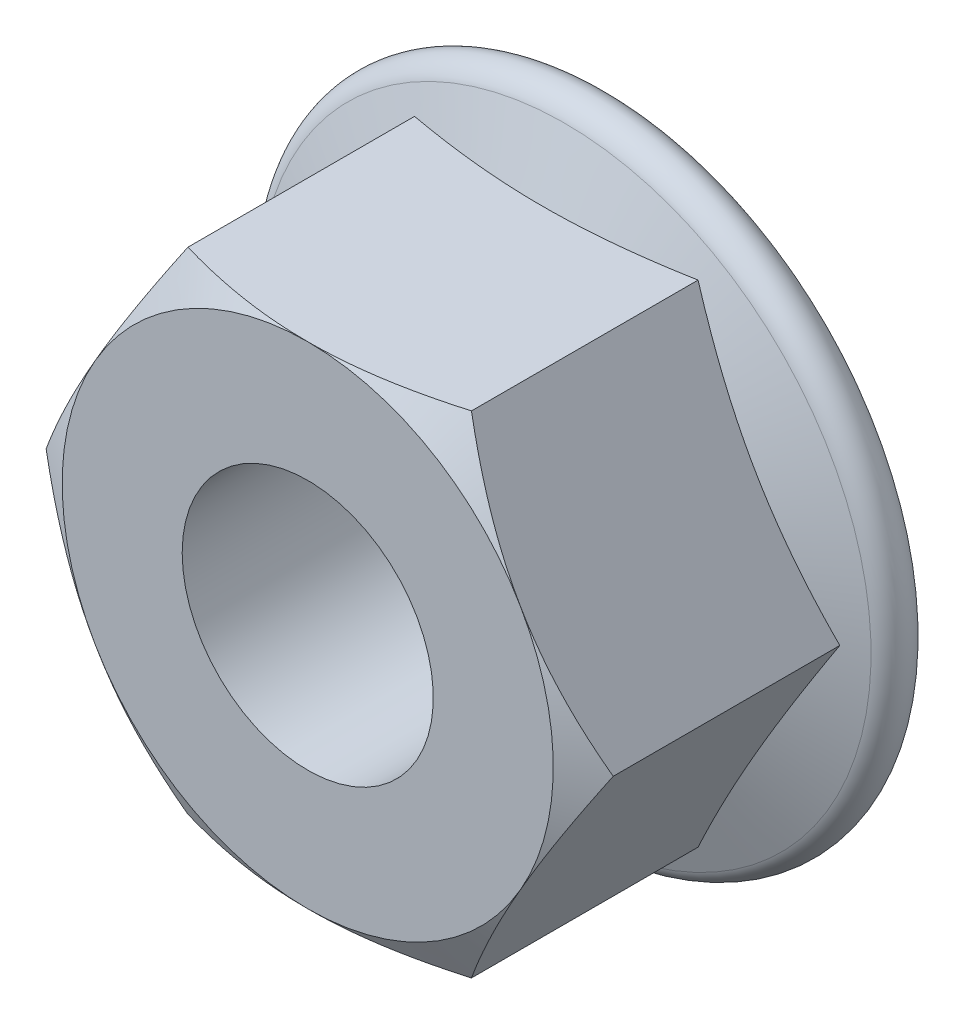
ISO-10303-21;
HEADER;
FILE_DESCRIPTION(('STEP AP214'),'2;1');
FILE_NAME('part.step','',(''),(''),'','','');
FILE_SCHEMA(('AUTOMOTIVE_DESIGN { 1 0 10303 214 1 1 1 1 }'));
ENDSEC;
DATA;
#1=APPLICATION_CONTEXT('core data for automotive mechanical design processes');
#2=APPLICATION_PROTOCOL_DEFINITION('international standard','automotive_design',2000,#1);
#3=PRODUCT_CONTEXT('',#1,'mechanical');
#4=PRODUCT('Part','Part','',(#3));
#5=PRODUCT_RELATED_PRODUCT_CATEGORY('part','',(#4));
#6=PRODUCT_DEFINITION_FORMATION('','',#4);
#7=PRODUCT_DEFINITION_CONTEXT('part definition',#1,'design');
#8=PRODUCT_DEFINITION('design','',#6,#7);
#9=PRODUCT_DEFINITION_SHAPE('','',#8);
#10=(LENGTH_UNIT() NAMED_UNIT(*) SI_UNIT(.MILLI.,.METRE.));
#11=(NAMED_UNIT(*) PLANE_ANGLE_UNIT() SI_UNIT($,.RADIAN.));
#12=(NAMED_UNIT(*) SI_UNIT($,.STERADIAN.) SOLID_ANGLE_UNIT());
#13=UNCERTAINTY_MEASURE_WITH_UNIT(LENGTH_MEASURE(1.E-05),#10,'distance_accuracy_value','');
#14=(GEOMETRIC_REPRESENTATION_CONTEXT(3) GLOBAL_UNCERTAINTY_ASSIGNED_CONTEXT((#13)) GLOBAL_UNIT_ASSIGNED_CONTEXT((#10,
#11,#12)) REPRESENTATION_CONTEXT('',''));
#15=CARTESIAN_POINT('',(0.,0.,0.));
#16=DIRECTION('',(0.,0.,1.));
#17=DIRECTION('',(1.,0.,0.));
#18=AXIS2_PLACEMENT_3D('',#15,#16,#17);
#19=CARTESIAN_POINT('',(-7.50555349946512,0.,8.));
#20=DIRECTION('',(0.86602540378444,-0.499999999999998,0.));
#21=DIRECTION('',(0.499999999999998,0.86602540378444,0.));
#22=AXIS2_PLACEMENT_3D('',#19,#20,#21);
#23=PLANE('',#22);
#24=CARTESIAN_POINT('',(-7.50566896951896,-0.000199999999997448,1.42053808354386));
#25=CARTESIAN_POINT('',(-7.35024872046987,0.268995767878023,1.47712763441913));
#26=CARTESIAN_POINT('',(-7.19431596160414,0.53907922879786,1.5286056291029));
#27=CARTESIAN_POINT('',(-6.88143655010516,1.08100226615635,1.61917320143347));
#28=CARTESIAN_POINT('',(-6.72448920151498,1.35284304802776,1.65825308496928));
#29=CARTESIAN_POINT('',(-6.41132237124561,1.89526390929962,1.7214636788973));
#30=CARTESIAN_POINT('',(-6.25511004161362,2.16583160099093,1.74573226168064));
#31=CARTESIAN_POINT('',(-5.94232007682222,2.70759971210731,1.77828325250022));
#32=CARTESIAN_POINT('',(-5.78574260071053,2.97879985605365,1.78657165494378));
#33=CARTESIAN_POINT('',(-5.47258764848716,3.52120014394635,1.78657165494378));
#34=CARTESIAN_POINT('',(-5.31601017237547,3.7924002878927,1.77828325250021));
#35=CARTESIAN_POINT('',(-5.00322020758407,4.33416839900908,1.74573226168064));
#36=CARTESIAN_POINT('',(-4.84700787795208,4.60473609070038,1.7214636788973));
#37=CARTESIAN_POINT('',(-4.53384104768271,5.14715695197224,1.65825308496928));
#38=CARTESIAN_POINT('',(-4.37689369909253,5.41899773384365,1.61917320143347));
#39=CARTESIAN_POINT('',(-4.06401428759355,5.96092077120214,1.52860562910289));
#40=CARTESIAN_POINT('',(-3.90808152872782,6.23100423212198,1.47712763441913));
#41=CARTESIAN_POINT('',(-3.75266127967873,6.5002,1.42053808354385));
#42=B_SPLINE_CURVE_WITH_KNOTS('',3,(#24,#25,#26,#27,#28,#29,#30,#31,#32,#33,#34,#35,#36,#37,#38,
#39,#40,#41),.UNSPECIFIED.,.F.,.F.,(4,2,2,2,2,2,2,2,4),(0.,0.947946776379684,1.89663293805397,
2.83634783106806,3.77571015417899,4.71507247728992,5.65478737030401,6.60347353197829,
7.55142030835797),.UNSPECIFIED.);
#43=CARTESIAN_POINT('',(-7.50555349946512,0.,1.42058011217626));
#44=VERTEX_POINT('',#43);
#45=CARTESIAN_POINT('',(-3.75277674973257,6.5,1.42058011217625));
#46=VERTEX_POINT('',#45);
#47=EDGE_CURVE('E122',#44,#46,#42,.T.);
#48=ORIENTED_EDGE('',*,*,#47,.F.);
#49=DIRECTION('',(0.,0.,-1.));
#50=VECTOR('',#49,1.);
#51=CARTESIAN_POINT('',(-7.50555349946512,0.,8.));
#52=LINE('',#51,#50);
#53=CARTESIAN_POINT('',(-7.50555349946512,0.,7.41944341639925));
#54=VERTEX_POINT('',#53);
#55=EDGE_CURVE('E252',#54,#44,#52,.T.);
#56=ORIENTED_EDGE('',*,*,#55,.F.);
#57=CARTESIAN_POINT('',(-7.50566896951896,-0.000199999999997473,7.41937674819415));
#58=CARTESIAN_POINT('',(-7.42317863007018,0.142677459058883,7.46699557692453));
#59=CARTESIAN_POINT('',(-7.34038072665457,0.286087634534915,7.51245329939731));
#60=CARTESIAN_POINT('',(-7.17411251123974,0.574072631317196,7.59845131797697));
#61=CARTESIAN_POINT('',(-7.09064192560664,0.718647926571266,7.63898949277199));
#62=CARTESIAN_POINT('',(-6.83889369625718,1.15468865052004,7.7524289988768));
#63=CARTESIAN_POINT('',(-6.6696223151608,1.44787528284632,7.81695219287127));
#64=CARTESIAN_POINT('',(-6.41631077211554,1.88662374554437,7.89261341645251));
#65=CARTESIAN_POINT('',(-6.33302748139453,2.03087463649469,7.91416714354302));
#66=CARTESIAN_POINT('',(-6.16608458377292,2.32002821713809,7.95030968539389));
#67=CARTESIAN_POINT('',(-6.08242501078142,2.46493084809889,7.96489911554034));
#68=CARTESIAN_POINT('',(-5.91496056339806,2.75498777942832,7.98674124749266));
#69=CARTESIAN_POINT('',(-5.8311559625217,2.90014160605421,7.9940022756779));
#70=CARTESIAN_POINT('',(-5.66347396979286,3.19057533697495,8.00103969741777));
#71=CARTESIAN_POINT('',(-5.5795965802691,3.33585523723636,8.0008163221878));
#72=CARTESIAN_POINT('',(-5.34979921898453,3.73387594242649,7.98991654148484));
#73=CARTESIAN_POINT('',(-5.20395446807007,3.98648646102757,7.97161818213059));
#74=CARTESIAN_POINT('',(-4.91323365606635,4.49002967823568,7.91359365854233));
#75=CARTESIAN_POINT('',(-4.76835861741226,4.74096060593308,7.87384766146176));
#76=CARTESIAN_POINT('',(-4.47705272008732,5.24551722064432,7.77449409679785));
#77=CARTESIAN_POINT('',(-4.33065861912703,5.49907924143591,7.71446557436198));
#78=CARTESIAN_POINT('',(-4.04005357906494,6.00242193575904,7.57822500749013));
#79=CARTESIAN_POINT('',(-3.89583891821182,6.25220905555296,7.50204496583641));
#80=CARTESIAN_POINT('',(-3.75266127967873,6.5002,7.41937674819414));
#81=B_SPLINE_CURVE_WITH_KNOTS('',3,(#57,#58,#59,#60,#61,#62,#63,#64,#65,#66,#67,#68,#69,#70,#71,
#72,#73,#74,#75,#76,#77,#78,#79,#80),.UNSPECIFIED.,.F.,.F.,(4,2,2,2,2,2,2,2,2,2,2,4),(0.,
0.515105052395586,1.03043143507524,2.06322554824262,2.56697389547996,3.07067772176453,
3.57380860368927,4.07692394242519,4.95279354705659,5.82947446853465,6.72559912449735,
7.61996451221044),.UNSPECIFIED.);
#82=CARTESIAN_POINT('',(-5.62916512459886,3.24999999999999,8.));
#83=VERTEX_POINT('',#82);
#84=EDGE_CURVE('E222',#54,#83,#81,.T.);
#85=ORIENTED_EDGE('',*,*,#84,.T.);
#86=CARTESIAN_POINT('',(-3.75277674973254,6.5,7.41944341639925));
#87=VERTEX_POINT('',#86);
#88=EDGE_CURVE('E217',#83,#87,#81,.T.);
#89=ORIENTED_EDGE('',*,*,#88,.T.);
#90=DIRECTION('',(0.,0.,-1.));
#91=VECTOR('',#90,1.);
#92=CARTESIAN_POINT('',(-3.75277674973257,6.5,8.));
#93=LINE('',#92,#91);
#94=EDGE_CURVE('E114',#87,#46,#93,.T.);
#95=ORIENTED_EDGE('',*,*,#94,.T.);
#96=EDGE_LOOP('',(#48,#56,#85,#89,#95));
#97=FACE_BOUND('',#96,.T.);
#98=ADVANCED_FACE('F29',(#97),#23,.F.);
#99=CARTESIAN_POINT('',(-3.75277674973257,-6.5,8.));
#100=DIRECTION('',(0.86602540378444,0.499999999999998,0.));
#101=DIRECTION('',(-0.499999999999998,0.86602540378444,0.));
#102=AXIS2_PLACEMENT_3D('',#99,#100,#101);
#103=PLANE('',#102);
#104=CARTESIAN_POINT('',(-3.75266127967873,-6.5002,1.42053808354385));
#105=CARTESIAN_POINT('',(-3.90808152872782,-6.23100423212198,1.47712763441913));
#106=CARTESIAN_POINT('',(-4.06401428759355,-5.96092077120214,1.52860562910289));
#107=CARTESIAN_POINT('',(-4.37689369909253,-5.41899773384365,1.61917320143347));
#108=CARTESIAN_POINT('',(-4.53384104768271,-5.14715695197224,1.65825308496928));
#109=CARTESIAN_POINT('',(-4.84700787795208,-4.60473609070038,1.7214636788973));
#110=CARTESIAN_POINT('',(-5.00322020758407,-4.33416839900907,1.74573226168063));
#111=CARTESIAN_POINT('',(-5.31601017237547,-3.79240028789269,1.77828325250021));
#112=CARTESIAN_POINT('',(-5.47258764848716,-3.52120014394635,1.78657165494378));
#113=CARTESIAN_POINT('',(-5.78574260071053,-2.97879985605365,1.78657165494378));
#114=CARTESIAN_POINT('',(-5.94232007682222,-2.7075997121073,1.77828325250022));
#115=CARTESIAN_POINT('',(-6.25511004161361,-2.16583160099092,1.74573226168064));
#116=CARTESIAN_POINT('',(-6.4113223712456,-1.89526390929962,1.7214636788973));
#117=CARTESIAN_POINT('',(-6.72448920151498,-1.35284304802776,1.65825308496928));
#118=CARTESIAN_POINT('',(-6.88143655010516,-1.08100226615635,1.61917320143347));
#119=CARTESIAN_POINT('',(-7.19431596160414,-0.539079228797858,1.5286056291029));
#120=CARTESIAN_POINT('',(-7.35024872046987,-0.26899576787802,1.47712763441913));
#121=CARTESIAN_POINT('',(-7.50566896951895,0.000200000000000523,1.42053808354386));
#122=B_SPLINE_CURVE_WITH_KNOTS('',3,(#104,#105,#106,#107,#108,#109,#110,#111,#112,#113,#114,
#115,#116,#117,#118,#119,#120,#121),.UNSPECIFIED.,.F.,.F.,(4,2,2,2,2,2,2,2,4),(0.,
0.947946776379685,1.89663293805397,2.83634783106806,3.77571015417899,4.71507247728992,
5.65478737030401,6.60347353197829,7.55142030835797),.UNSPECIFIED.);
#123=CARTESIAN_POINT('',(-3.75277674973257,-6.5,1.42058011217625));
#124=VERTEX_POINT('',#123);
#125=EDGE_CURVE('E49',#124,#44,#122,.T.);
#126=ORIENTED_EDGE('',*,*,#125,.F.);
#127=DIRECTION('',(0.,0.,-1.));
#128=VECTOR('',#127,1.);
#129=CARTESIAN_POINT('',(-3.75277674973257,-6.5,8.));
#130=LINE('',#129,#128);
#131=CARTESIAN_POINT('',(-3.75277674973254,-6.5,7.41944341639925));
#132=VERTEX_POINT('',#131);
#133=EDGE_CURVE('E238',#132,#124,#130,.T.);
#134=ORIENTED_EDGE('',*,*,#133,.F.);
#135=CARTESIAN_POINT('',(-3.75266127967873,-6.5002,7.41937674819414));
#136=CARTESIAN_POINT('',(-3.83515161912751,-6.35732254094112,7.46699557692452));
#137=CARTESIAN_POINT('',(-3.91794952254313,-6.21391236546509,7.5124532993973));
#138=CARTESIAN_POINT('',(-4.08421773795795,-5.9259273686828,7.59845131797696));
#139=CARTESIAN_POINT('',(-4.16768832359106,-5.78135207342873,7.63898949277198));
#140=CARTESIAN_POINT('',(-4.41943655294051,-5.34531134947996,7.75242899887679));
#141=CARTESIAN_POINT('',(-4.58870793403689,-5.05212471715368,7.81695219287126));
#142=CARTESIAN_POINT('',(-4.84201947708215,-4.61337625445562,7.89261341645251));
#143=CARTESIAN_POINT('',(-4.92530276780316,-4.46912536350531,7.91416714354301));
#144=CARTESIAN_POINT('',(-5.09224566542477,-4.17997178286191,7.95030968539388));
#145=CARTESIAN_POINT('',(-5.17590523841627,-4.03506915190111,7.96489911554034));
#146=CARTESIAN_POINT('',(-5.34336968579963,-3.74501222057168,7.98674124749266));
#147=CARTESIAN_POINT('',(-5.427174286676,-3.59985839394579,7.9940022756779));
#148=CARTESIAN_POINT('',(-5.59485627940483,-3.30942466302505,8.00103969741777));
#149=CARTESIAN_POINT('',(-5.6787336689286,-3.16414476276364,8.0008163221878));
#150=CARTESIAN_POINT('',(-5.90853103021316,-2.7661240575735,7.98991654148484));
#151=CARTESIAN_POINT('',(-6.05437578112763,-2.51351353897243,7.97161818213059));
#152=CARTESIAN_POINT('',(-6.34509659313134,-2.00997032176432,7.91359365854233));
#153=CARTESIAN_POINT('',(-6.48997163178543,-1.75903939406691,7.87384766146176));
#154=CARTESIAN_POINT('',(-6.78127752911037,-1.25448277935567,7.77449409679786));
#155=CARTESIAN_POINT('',(-6.92767163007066,-1.00092075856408,7.71446557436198));
#156=CARTESIAN_POINT('',(-7.21827667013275,-0.497578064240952,7.57822500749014));
#157=CARTESIAN_POINT('',(-7.36249133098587,-0.247790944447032,7.50204496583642));
#158=CARTESIAN_POINT('',(-7.50566896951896,0.000200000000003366,7.41937674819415));
#159=B_SPLINE_CURVE_WITH_KNOTS('',3,(#135,#136,#137,#138,#139,#140,#141,#142,#143,#144,#145,
#146,#147,#148,#149,#150,#151,#152,#153,#154,#155,#156,#157,#158),.UNSPECIFIED.,.F.,.F.,(4,2,2,
2,2,2,2,2,2,2,2,4),(0.,0.515105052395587,1.03043143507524,2.06322554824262,2.56697389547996,
3.07067772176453,3.57380860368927,4.0769239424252,4.9527935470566,5.82947446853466,
6.72559912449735,7.61996451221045),.UNSPECIFIED.);
#160=CARTESIAN_POINT('',(-5.62916512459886,-3.24999999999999,8.));
#161=VERTEX_POINT('',#160);
#162=EDGE_CURVE('E183',#132,#161,#159,.T.);
#163=ORIENTED_EDGE('',*,*,#162,.T.);
#164=EDGE_CURVE('E176',#161,#54,#159,.T.);
#165=ORIENTED_EDGE('',*,*,#164,.T.);
#166=ORIENTED_EDGE('',*,*,#55,.T.);
#167=EDGE_LOOP('',(#126,#134,#163,#165,#166));
#168=FACE_BOUND('',#167,.T.);
#169=ADVANCED_FACE('F168',(#168),#103,.F.);
#170=CARTESIAN_POINT('',(3.75277674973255,-6.5,8.));
#171=DIRECTION('',(0.,1.,0.));
#172=DIRECTION('',(-1.,0.,0.));
#173=AXIS2_PLACEMENT_3D('',#170,#171,#172);
#174=PLANE('',#173);
#175=CARTESIAN_POINT('',(-9.95705959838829,-6.5,-0.175548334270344));
#176=CARTESIAN_POINT('',(-9.66274604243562,-6.5,-0.0858731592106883));
#177=CARTESIAN_POINT('',(-9.36810918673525,-6.5,0.00276023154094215));
#178=CARTESIAN_POINT('',(-8.77802422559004,-6.5,0.177367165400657));
#179=CARTESIAN_POINT('',(-8.4825760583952,-6.5,0.263340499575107));
#180=CARTESIAN_POINT('',(-7.89020332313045,-6.5,0.432192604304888));
#181=CARTESIAN_POINT('',(-7.59327703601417,-6.5,0.515065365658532));
#182=CARTESIAN_POINT('',(-6.99832282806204,-6.5,0.67675165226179));
#183=CARTESIAN_POINT('',(-6.70029492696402,-6.5,0.755565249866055));
#184=CARTESIAN_POINT('',(-6.10661021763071,-6.5,0.907189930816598));
#185=CARTESIAN_POINT('',(-5.81096928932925,-6.5,0.980062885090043));
#186=CARTESIAN_POINT('',(-5.21821870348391,-6.5,1.11963621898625));
#187=CARTESIAN_POINT('',(-4.92110902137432,-6.5,1.18633649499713));
#188=CARTESIAN_POINT('',(-4.32535015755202,-6.5,1.31201642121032));
#189=CARTESIAN_POINT('',(-4.02670151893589,-6.5,1.37099862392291));
#190=CARTESIAN_POINT('',(-3.42766936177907,-6.5,1.47945221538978));
#191=CARTESIAN_POINT('',(-3.12728590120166,-6.5,1.52892392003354));
#192=CARTESIAN_POINT('',(-2.55856410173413,-6.5,1.61145620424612));
#193=CARTESIAN_POINT('',(-2.29040408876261,-6.5,1.64573416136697));
#194=CARTESIAN_POINT('',(-1.75294378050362,-6.5,1.70382895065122));
#195=CARTESIAN_POINT('',(-1.48364351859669,-6.5,1.72764608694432));
#196=CARTESIAN_POINT('',(-0.944449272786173,-6.5,1.76367259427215));
#197=CARTESIAN_POINT('',(-0.674555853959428,-6.5,1.77589028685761));
#198=CARTESIAN_POINT('',(-0.134489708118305,-6.5,1.78809886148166));
#199=CARTESIAN_POINT('',(0.135683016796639,-6.5,1.78808983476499));
#200=CARTESIAN_POINT('',(0.677117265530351,-6.5,1.7758142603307));
#201=CARTESIAN_POINT('',(0.948377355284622,-6.5,1.76348549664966));
#202=CARTESIAN_POINT('',(1.49010637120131,-6.5,1.72713736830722));
#203=CARTESIAN_POINT('',(1.76057527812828,-6.5,1.70311772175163));
#204=CARTESIAN_POINT('',(2.30058677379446,-6.5,1.64451587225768));
#205=CARTESIAN_POINT('',(2.57012835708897,-6.5,1.60992453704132));
#206=CARTESIAN_POINT('',(3.10786295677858,-6.5,1.53158869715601));
#207=CARTESIAN_POINT('',(3.37605596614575,-6.5,1.48784414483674));
#208=CARTESIAN_POINT('',(3.92636982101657,-6.5,1.38990681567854));
#209=CARTESIAN_POINT('',(4.20840900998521,-6.5,1.33525925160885));
#210=CARTESIAN_POINT('',(4.77103112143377,-6.5,1.21887860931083));
#211=CARTESIAN_POINT('',(5.05161393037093,-6.5,1.1571449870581));
#212=CARTESIAN_POINT('',(5.61152576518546,-6.5,1.02790295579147));
#213=CARTESIAN_POINT('',(5.89085439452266,-6.5,0.960392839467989));
#214=CARTESIAN_POINT('',(6.44832943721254,-6.5,0.820706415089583));
#215=CARTESIAN_POINT('',(6.72647587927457,-6.5,0.748530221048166));
#216=CARTESIAN_POINT('',(7.282115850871,-6.5,0.600292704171));
#217=CARTESIAN_POINT('',(7.55960805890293,-6.5,0.524226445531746));
#218=CARTESIAN_POINT('',(8.11372449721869,-6.5,0.368989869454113));
#219=CARTESIAN_POINT('',(8.39034871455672,-6.50000000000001,0.289819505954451));
#220=CARTESIAN_POINT('',(9.21901478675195,-6.50000000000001,0.0485467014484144));
#221=CARTESIAN_POINT('',(9.76995253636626,-6.50000000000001,-0.117345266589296));
#222=CARTESIAN_POINT('',(10.8636282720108,-6.50000000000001,-0.454181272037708));
#223=CARTESIAN_POINT('',(11.406389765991,-6.50000000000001,-0.625049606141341));
#224=CARTESIAN_POINT('',(12.4903900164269,-6.50000000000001,-0.971630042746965));
#225=CARTESIAN_POINT('',(13.0316286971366,-6.50000000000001,-1.14734238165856));
#226=CARTESIAN_POINT('',(14.1108650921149,-6.50000000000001,-1.50162139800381));
#227=CARTESIAN_POINT('',(14.6488672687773,-6.50000000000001,-1.68017451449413));
#228=CARTESIAN_POINT('',(15.4551843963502,-6.50000000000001,-1.94997777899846));
#229=CARTESIAN_POINT('',(15.7238314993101,-6.50000000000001,-2.04023741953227));
#230=CARTESIAN_POINT('',(16.2609289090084,-6.50000000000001,-2.22133828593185));
#231=CARTESIAN_POINT('',(16.5293792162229,-6.50000000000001,-2.31217951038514));
#232=CARTESIAN_POINT('',(16.7977440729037,-6.50000000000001,-2.40327244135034));
#233=B_SPLINE_CURVE_WITH_KNOTS('',3,(#175,#176,#177,#178,#179,#180,#181,#182,#183,#184,#185,
#186,#187,#188,#189,#190,#191,#192,#193,#194,#195,#196,#197,#198,#199,#200,#201,#202,#203,#204,
#205,#206,#207,#208,#209,#210,#211,#212,#213,#214,#215,#216,#217,#218,#219,#220,#221,#222,#223,
#224,#225,#226,#227,#228,#229,#230,#231,#232),.UNSPECIFIED.,.F.,.F.,(4,2,2,2,2,2,2,2,2,2,2,2,2,
2,2,2,2,2,2,2,2,2,2,2,2,2,2,2,4),(0.,0.923022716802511,1.84611774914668,2.77091780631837,
3.69570137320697,4.60911835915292,5.52255067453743,6.43568013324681,7.34877925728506,
8.15962762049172,8.97045240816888,9.78069506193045,10.5909316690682,11.4052808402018,
12.2196496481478,13.0347239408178,13.8498024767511,14.7115445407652,15.5733528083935,
16.4354166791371,17.2974594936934,18.1606246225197,19.0238025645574,20.7498399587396,
22.4568795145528,24.1640025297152,25.8645664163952,26.7147791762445,27.5649898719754),.UNSPECIFIED.);
#234=CARTESIAN_POINT('',(3.75277674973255,-6.5,1.42058011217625));
#235=VERTEX_POINT('',#234);
#236=EDGE_CURVE('E54',#235,#124,#233,.F.);
#237=ORIENTED_EDGE('',*,*,#236,.F.);
#238=DIRECTION('',(0.,0.,-1.));
#239=VECTOR('',#238,1.);
#240=CARTESIAN_POINT('',(3.75277674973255,-6.5,8.));
#241=LINE('',#240,#239);
#242=CARTESIAN_POINT('',(3.75277674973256,-6.49999999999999,7.41944341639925));
#243=VERTEX_POINT('',#242);
#244=EDGE_CURVE('E247',#243,#235,#241,.T.);
#245=ORIENTED_EDGE('',*,*,#244,.F.);
#246=CARTESIAN_POINT('',(-9.95291698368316,-6.5,4.88957641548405));
#247=CARTESIAN_POINT('',(-9.66753022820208,-6.5,5.02749106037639));
#248=CARTESIAN_POINT('',(-9.3814687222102,-6.5,5.16403471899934));
#249=CARTESIAN_POINT('',(-8.80763137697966,-6.5,5.43359663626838));
#250=CARTESIAN_POINT('',(-8.51985525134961,-6.5,5.56661428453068));
#251=CARTESIAN_POINT('',(-7.94066929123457,-6.5,5.82904149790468));
#252=CARTESIAN_POINT('',(-7.64924808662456,-6.5,5.95842605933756));
#253=CARTESIAN_POINT('',(-7.06401043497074,-6.5,6.21163779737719));
#254=CARTESIAN_POINT('',(-6.77019411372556,-6.5,6.33546526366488));
#255=CARTESIAN_POINT('',(-6.17605150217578,-6.5,6.5775551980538));
#256=CARTESIAN_POINT('',(-5.87568957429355,-6.5,6.69573068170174));
#257=CARTESIAN_POINT('',(-5.27142269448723,-6.5,6.92282610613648));
#258=CARTESIAN_POINT('',(-4.9675173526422,-6.5,7.03174501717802));
#259=CARTESIAN_POINT('',(-4.35630541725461,-6.5,7.23740097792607));
#260=CARTESIAN_POINT('',(-4.04900762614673,-6.5,7.33416392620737));
#261=CARTESIAN_POINT('',(-3.43004022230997,-6.5,7.51236428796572));
#262=CARTESIAN_POINT('',(-3.11837202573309,-6.5,7.59380654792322));
#263=CARTESIAN_POINT('',(-2.49046594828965,-6.5,7.73741591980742));
#264=CARTESIAN_POINT('',(-2.17422687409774,-6.5,7.79957789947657));
#265=CARTESIAN_POINT('',(-1.5378916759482,-6.5,7.90042577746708));
#266=CARTESIAN_POINT('',(-1.21779554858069,-6.5,7.93911165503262));
#267=CARTESIAN_POINT('',(-0.73714196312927,-6.5,7.977053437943));
#268=CARTESIAN_POINT('',(-0.577336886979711,-6.5,7.98635478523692));
#269=CARTESIAN_POINT('',(-0.257468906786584,-6.5,7.99818591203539));
#270=CARTESIAN_POINT('',(-0.0974060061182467,-6.5,8.00071577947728));
#271=CARTESIAN_POINT('',(0.222635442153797,-6.5,7.99893598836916));
#272=CARTESIAN_POINT('',(0.382614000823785,-6.5,7.99462824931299));
#273=CARTESIAN_POINT('',(0.702250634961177,-6.5,7.97928241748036));
#274=CARTESIAN_POINT('',(0.86190869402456,-6.5,7.96824398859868));
#275=CARTESIAN_POINT('',(1.24887053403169,-6.5,7.93356313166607));
#276=CARTESIAN_POINT('',(1.47587694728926,-6.5,7.90654812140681));
#277=CARTESIAN_POINT('',(1.92815030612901,-6.5,7.84041011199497));
#278=CARTESIAN_POINT('',(2.15341675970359,-6.5,7.80128380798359));
#279=CARTESIAN_POINT('',(2.60202427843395,-6.5,7.71231082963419));
#280=CARTESIAN_POINT('',(2.82536331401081,-6.5,7.6624540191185));
#281=CARTESIAN_POINT('',(3.26974354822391,-6.5,7.55354123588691));
#282=CARTESIAN_POINT('',(3.49078496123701,-6.5,7.4944861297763));
#283=CARTESIAN_POINT('',(3.93601414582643,-6.5,7.3670458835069));
#284=CARTESIAN_POINT('',(4.16014622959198,-6.5,7.29846752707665));
#285=CARTESIAN_POINT('',(4.60604131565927,-6.5,7.15453487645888));
#286=CARTESIAN_POINT('',(4.82780583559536,-6.5,7.07918525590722));
#287=CARTESIAN_POINT('',(5.26807593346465,-6.5,6.92326649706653));
#288=CARTESIAN_POINT('',(5.48659282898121,-6.5,6.84272912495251));
#289=CARTESIAN_POINT('',(5.92193123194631,-6.5,6.6769272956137));
#290=CARTESIAN_POINT('',(6.13875201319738,-6.5,6.59166092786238));
#291=CARTESIAN_POINT('',(6.35478510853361,-6.5,6.50449786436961));
#292=B_SPLINE_CURVE_WITH_KNOTS('',3,(#246,#247,#248,#249,#250,#251,#252,#253,#254,#255,#256,
#257,#258,#259,#260,#261,#262,#263,#264,#265,#266,#267,#268,#269,#270,#271,#272,#273,#274,#275,
#276,#277,#278,#279,#280,#281,#282,#283,#284,#285,#286,#287,#288,#289,#290,#291),.UNSPECIFIED.,
.F.,.F.,(4,2,2,2,2,2,2,2,2,2,2,2,2,2,2,2,2,2,2,2,2,2,4),(0.,0.950904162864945,1.90197187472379,
2.85848216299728,3.81494253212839,4.78314526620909,5.75145556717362,6.71766655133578,
7.6835713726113,8.64973308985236,9.61589566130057,10.0960003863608,10.5760988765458,
11.0560626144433,11.5360503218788,12.2214931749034,12.9071232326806,13.5934038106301,
14.2796197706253,14.9826563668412,15.685211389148,16.3838119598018,17.0826968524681),.UNSPECIFIED.);
#293=CARTESIAN_POINT('',(0.,-6.5,8.));
#294=VERTEX_POINT('',#293);
#295=EDGE_CURVE('E234',#243,#294,#292,.F.);
#296=ORIENTED_EDGE('',*,*,#295,.T.);
#297=EDGE_CURVE('E189',#294,#132,#292,.F.);
#298=ORIENTED_EDGE('',*,*,#297,.T.);
#299=ORIENTED_EDGE('',*,*,#133,.T.);
#300=EDGE_LOOP('',(#237,#245,#296,#298,#299));
#301=FACE_BOUND('',#300,.T.);
#302=ADVANCED_FACE('F171',(#301),#174,.F.);
#303=CARTESIAN_POINT('',(7.50555349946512,0.,8.));
#304=DIRECTION('',(-0.866025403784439,0.5,0.));
#305=DIRECTION('',(-0.5,-0.866025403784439,0.));
#306=AXIS2_PLACEMENT_3D('',#303,#304,#305);
#307=PLANE('',#306);
#308=CARTESIAN_POINT('',(7.50566896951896,0.000200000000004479,1.42053808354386));
#309=CARTESIAN_POINT('',(7.35024872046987,-0.268995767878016,1.47712763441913));
#310=CARTESIAN_POINT('',(7.19431596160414,-0.539079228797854,1.5286056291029));
#311=CARTESIAN_POINT('',(6.88143655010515,-1.08100226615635,1.61917320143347));
#312=CARTESIAN_POINT('',(6.72448920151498,-1.35284304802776,1.65825308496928));
#313=CARTESIAN_POINT('',(6.4113223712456,-1.89526390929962,1.72146367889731));
#314=CARTESIAN_POINT('',(6.25511004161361,-2.16583160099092,1.74573226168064));
#315=CARTESIAN_POINT('',(5.94232007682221,-2.7075997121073,1.77828325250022));
#316=CARTESIAN_POINT('',(5.78574260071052,-2.97879985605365,1.78657165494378));
#317=CARTESIAN_POINT('',(5.47258764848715,-3.52120014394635,1.78657165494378));
#318=CARTESIAN_POINT('',(5.31601017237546,-3.79240028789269,1.77828325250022));
#319=CARTESIAN_POINT('',(5.00322020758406,-4.33416839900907,1.74573226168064));
#320=CARTESIAN_POINT('',(4.84700787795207,-4.60473609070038,1.72146367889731));
#321=CARTESIAN_POINT('',(4.53384104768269,-5.14715695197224,1.65825308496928));
#322=CARTESIAN_POINT('',(4.37689369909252,-5.41899773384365,1.61917320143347));
#323=CARTESIAN_POINT('',(4.06401428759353,-5.96092077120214,1.5286056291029));
#324=CARTESIAN_POINT('',(3.9080815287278,-6.23100423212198,1.47712763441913));
#325=CARTESIAN_POINT('',(3.75266127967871,-6.5002,1.42053808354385));
#326=B_SPLINE_CURVE_WITH_KNOTS('',3,(#308,#309,#310,#311,#312,#313,#314,#315,#316,#317,#318,
#319,#320,#321,#322,#323,#324,#325),.UNSPECIFIED.,.F.,.F.,(4,2,2,2,2,2,2,2,4),(0.,
0.947946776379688,1.89663293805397,2.83634783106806,3.775710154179,4.71507247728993,
5.65478737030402,6.6034735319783,7.55142030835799),.UNSPECIFIED.);
#327=CARTESIAN_POINT('',(7.50555349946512,0.,1.42058011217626));
#328=VERTEX_POINT('',#327);
#329=EDGE_CURVE('E130',#328,#235,#326,.T.);
#330=ORIENTED_EDGE('',*,*,#329,.F.);
#331=DIRECTION('',(0.,0.,-1.));
#332=VECTOR('',#331,1.);
#333=CARTESIAN_POINT('',(7.50555349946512,0.,8.));
#334=LINE('',#333,#332);
#335=CARTESIAN_POINT('',(7.50555349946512,0.,7.41944341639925));
#336=VERTEX_POINT('',#335);
#337=EDGE_CURVE('E113',#336,#328,#334,.T.);
#338=ORIENTED_EDGE('',*,*,#337,.F.);
#339=CARTESIAN_POINT('',(7.50566896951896,0.0002000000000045,7.41937674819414));
#340=CARTESIAN_POINT('',(7.42317863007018,-0.142677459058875,7.46699557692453));
#341=CARTESIAN_POINT('',(7.34038072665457,-0.286087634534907,7.5124532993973));
#342=CARTESIAN_POINT('',(7.17411251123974,-0.574072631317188,7.59845131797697));
#343=CARTESIAN_POINT('',(7.09064192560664,-0.718647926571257,7.63898949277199));
#344=CARTESIAN_POINT('',(6.83889369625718,-1.15468865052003,7.7524289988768));
#345=CARTESIAN_POINT('',(6.66962231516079,-1.44787528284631,7.81695219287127));
#346=CARTESIAN_POINT('',(6.41631077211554,-1.88662374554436,7.89261341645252));
#347=CARTESIAN_POINT('',(6.33302748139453,-2.03087463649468,7.91416714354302));
#348=CARTESIAN_POINT('',(6.16608458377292,-2.32002821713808,7.95030968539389));
#349=CARTESIAN_POINT('',(6.08242501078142,-2.46493084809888,7.96489911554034));
#350=CARTESIAN_POINT('',(5.91496056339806,-2.75498777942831,7.98674124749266));
#351=CARTESIAN_POINT('',(5.83115596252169,-2.9001416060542,7.9940022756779));
#352=CARTESIAN_POINT('',(5.66347396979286,-3.19057533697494,8.00103969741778));
#353=CARTESIAN_POINT('',(5.57959658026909,-3.33585523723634,8.0008163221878));
#354=CARTESIAN_POINT('',(5.34979921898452,-3.73387594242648,7.98991654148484));
#355=CARTESIAN_POINT('',(5.20395446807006,-3.98648646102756,7.9716181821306));
#356=CARTESIAN_POINT('',(4.91323365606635,-4.49002967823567,7.91359365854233));
#357=CARTESIAN_POINT('',(4.76835861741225,-4.74096060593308,7.87384766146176));
#358=CARTESIAN_POINT('',(4.4770527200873,-5.24551722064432,7.77449409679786));
#359=CARTESIAN_POINT('',(4.33065861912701,-5.49907924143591,7.71446557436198));
#360=CARTESIAN_POINT('',(4.04005357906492,-6.00242193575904,7.57822500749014));
#361=CARTESIAN_POINT('',(3.8958389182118,-6.25220905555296,7.50204496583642));
#362=CARTESIAN_POINT('',(3.75266127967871,-6.5002,7.41937674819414));
#363=B_SPLINE_CURVE_WITH_KNOTS('',3,(#339,#340,#341,#342,#343,#344,#345,#346,#347,#348,#349,
#350,#351,#352,#353,#354,#355,#356,#357,#358,#359,#360,#361,#362),.UNSPECIFIED.,.F.,.F.,(4,2,2,
2,2,2,2,2,2,2,2,4),(0.,0.515105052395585,1.03043143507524,2.06322554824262,2.56697389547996,
3.07067772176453,3.57380860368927,4.07692394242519,4.95279354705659,5.82947446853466,
6.72559912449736,7.61996451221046),.UNSPECIFIED.);
#364=CARTESIAN_POINT('',(5.62916512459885,-3.25,8.));
#365=VERTEX_POINT('',#364);
#366=EDGE_CURVE('E184',#336,#365,#363,.T.);
#367=ORIENTED_EDGE('',*,*,#366,.T.);
#368=EDGE_CURVE('E228',#365,#243,#363,.T.);
#369=ORIENTED_EDGE('',*,*,#368,.T.);
#370=ORIENTED_EDGE('',*,*,#244,.T.);
#371=EDGE_LOOP('',(#330,#338,#367,#369,#370));
#372=FACE_BOUND('',#371,.T.);
#373=ADVANCED_FACE('F282',(#372),#307,.F.);
#374=CARTESIAN_POINT('',(3.75277674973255,6.5,8.));
#375=DIRECTION('',(-0.866025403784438,-0.500000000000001,0.));
#376=DIRECTION('',(0.500000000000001,-0.866025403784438,0.));
#377=AXIS2_PLACEMENT_3D('',#374,#375,#376);
#378=PLANE('',#377);
#379=CARTESIAN_POINT('',(3.75266127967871,6.5002,1.42053808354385));
#380=CARTESIAN_POINT('',(3.90808152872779,6.23100423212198,1.47712763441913));
#381=CARTESIAN_POINT('',(4.06401428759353,5.96092077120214,1.5286056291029));
#382=CARTESIAN_POINT('',(4.37689369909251,5.41899773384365,1.61917320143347));
#383=CARTESIAN_POINT('',(4.53384104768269,5.14715695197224,1.65825308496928));
#384=CARTESIAN_POINT('',(4.84700787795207,4.60473609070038,1.7214636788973));
#385=CARTESIAN_POINT('',(5.00322020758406,4.33416839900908,1.74573226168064));
#386=CARTESIAN_POINT('',(5.31601017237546,3.7924002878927,1.77828325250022));
#387=CARTESIAN_POINT('',(5.47258764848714,3.52120014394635,1.78657165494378));
#388=CARTESIAN_POINT('',(5.78574260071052,2.97879985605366,1.78657165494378));
#389=CARTESIAN_POINT('',(5.94232007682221,2.70759971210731,1.77828325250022));
#390=CARTESIAN_POINT('',(6.25511004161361,2.16583160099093,1.74573226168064));
#391=CARTESIAN_POINT('',(6.4113223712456,1.89526390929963,1.72146367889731));
#392=CARTESIAN_POINT('',(6.72448920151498,1.35284304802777,1.65825308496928));
#393=CARTESIAN_POINT('',(6.88143655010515,1.08100226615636,1.61917320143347));
#394=CARTESIAN_POINT('',(7.19431596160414,0.539079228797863,1.5286056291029));
#395=CARTESIAN_POINT('',(7.35024872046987,0.268995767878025,1.47712763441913));
#396=CARTESIAN_POINT('',(7.50566896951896,-0.000199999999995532,1.42053808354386));
#397=B_SPLINE_CURVE_WITH_KNOTS('',3,(#379,#380,#381,#382,#383,#384,#385,#386,#387,#388,#389,
#390,#391,#392,#393,#394,#395,#396),.UNSPECIFIED.,.F.,.F.,(4,2,2,2,2,2,2,2,4),(0.,
0.947946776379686,1.89663293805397,2.83634783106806,3.77571015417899,4.71507247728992,
5.65478737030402,6.6034735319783,7.55142030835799),.UNSPECIFIED.);
#398=CARTESIAN_POINT('',(3.75277674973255,6.5,1.42058011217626));
#399=VERTEX_POINT('',#398);
#400=EDGE_CURVE('E118',#399,#328,#397,.T.);
#401=ORIENTED_EDGE('',*,*,#400,.F.);
#402=DIRECTION('',(0.,0.,-1.));
#403=VECTOR('',#402,1.);
#404=CARTESIAN_POINT('',(3.75277674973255,6.5,8.));
#405=LINE('',#404,#403);
#406=CARTESIAN_POINT('',(3.75277674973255,6.5,7.41944341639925));
#407=VERTEX_POINT('',#406);
#408=EDGE_CURVE('E104',#407,#399,#405,.T.);
#409=ORIENTED_EDGE('',*,*,#408,.F.);
#410=CARTESIAN_POINT('',(3.75266127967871,6.5002,7.41937674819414));
#411=CARTESIAN_POINT('',(3.83515161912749,6.35732254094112,7.46699557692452));
#412=CARTESIAN_POINT('',(3.9179495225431,6.21391236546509,7.5124532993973));
#413=CARTESIAN_POINT('',(4.08421773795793,5.92592736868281,7.59845131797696));
#414=CARTESIAN_POINT('',(4.16768832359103,5.78135207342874,7.63898949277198));
#415=CARTESIAN_POINT('',(4.4194365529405,5.34531134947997,7.7524289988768));
#416=CARTESIAN_POINT('',(4.58870793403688,5.05212471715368,7.81695219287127));
#417=CARTESIAN_POINT('',(4.84201947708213,4.61337625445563,7.89261341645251));
#418=CARTESIAN_POINT('',(4.92530276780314,4.46912536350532,7.91416714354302));
#419=CARTESIAN_POINT('',(5.09224566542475,4.17997178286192,7.95030968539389));
#420=CARTESIAN_POINT('',(5.17590523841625,4.03506915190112,7.96489911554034));
#421=CARTESIAN_POINT('',(5.34336968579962,3.74501222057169,7.98674124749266));
#422=CARTESIAN_POINT('',(5.42717428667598,3.5998583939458,7.9940022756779));
#423=CARTESIAN_POINT('',(5.59485627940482,3.30942466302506,8.00103969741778));
#424=CARTESIAN_POINT('',(5.67873366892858,3.16414476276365,8.0008163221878));
#425=CARTESIAN_POINT('',(5.90853103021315,2.76612405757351,7.98991654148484));
#426=CARTESIAN_POINT('',(6.05437578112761,2.51351353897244,7.9716181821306));
#427=CARTESIAN_POINT('',(6.34509659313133,2.00997032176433,7.91359365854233));
#428=CARTESIAN_POINT('',(6.48997163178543,1.75903939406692,7.87384766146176));
#429=CARTESIAN_POINT('',(6.78127752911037,1.25448277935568,7.77449409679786));
#430=CARTESIAN_POINT('',(6.92767163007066,1.00092075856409,7.71446557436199));
#431=CARTESIAN_POINT('',(7.21827667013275,0.497578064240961,7.57822500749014));
#432=CARTESIAN_POINT('',(7.36249133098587,0.247790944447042,7.50204496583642));
#433=CARTESIAN_POINT('',(7.50566896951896,-0.000199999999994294,7.41937674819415));
#434=B_SPLINE_CURVE_WITH_KNOTS('',3,(#410,#411,#412,#413,#414,#415,#416,#417,#418,#419,#420,
#421,#422,#423,#424,#425,#426,#427,#428,#429,#430,#431,#432,#433),.UNSPECIFIED.,.F.,.F.,(4,2,2,
2,2,2,2,2,2,2,2,4),(0.,0.515105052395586,1.03043143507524,2.06322554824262,2.56697389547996,
3.07067772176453,3.57380860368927,4.07692394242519,4.9527935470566,5.82947446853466,
6.72559912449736,7.61996451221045),.UNSPECIFIED.);
#435=CARTESIAN_POINT('',(5.62916512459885,3.25,8.));
#436=VERTEX_POINT('',#435);
#437=EDGE_CURVE('E212',#407,#436,#434,.T.);
#438=ORIENTED_EDGE('',*,*,#437,.T.);
#439=EDGE_CURVE('E224',#436,#336,#434,.T.);
#440=ORIENTED_EDGE('',*,*,#439,.T.);
#441=ORIENTED_EDGE('',*,*,#337,.T.);
#442=EDGE_LOOP('',(#401,#409,#438,#440,#441));
#443=FACE_BOUND('',#442,.T.);
#444=ADVANCED_FACE('F119',(#443),#378,.F.);
#445=CARTESIAN_POINT('',(-3.75277674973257,6.5,8.));
#446=DIRECTION('',(0.,-1.,0.));
#447=DIRECTION('',(1.,0.,0.));
#448=AXIS2_PLACEMENT_3D('',#445,#446,#447);
#449=PLANE('',#448);
#450=CARTESIAN_POINT('',(-9.95705959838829,6.5,-0.175548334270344));
#451=CARTESIAN_POINT('',(-9.66274604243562,6.5,-0.0858731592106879));
#452=CARTESIAN_POINT('',(-9.36810918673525,6.5,0.00276023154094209));
#453=CARTESIAN_POINT('',(-8.77802422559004,6.5,0.177367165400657));
#454=CARTESIAN_POINT('',(-8.4825760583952,6.5,0.263340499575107));
#455=CARTESIAN_POINT('',(-7.89020332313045,6.5,0.432192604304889));
#456=CARTESIAN_POINT('',(-7.59327703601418,6.5,0.515065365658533));
#457=CARTESIAN_POINT('',(-6.99832282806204,6.5,0.676751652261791));
#458=CARTESIAN_POINT('',(-6.70029492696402,6.5,0.755565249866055));
#459=CARTESIAN_POINT('',(-6.10661021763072,6.5,0.907189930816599));
#460=CARTESIAN_POINT('',(-5.81096928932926,6.5,0.980062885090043));
#461=CARTESIAN_POINT('',(-5.21821870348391,6.5,1.11963621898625));
#462=CARTESIAN_POINT('',(-4.92110902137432,6.5,1.18633649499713));
#463=CARTESIAN_POINT('',(-4.32535015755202,6.5,1.31201642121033));
#464=CARTESIAN_POINT('',(-4.02670151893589,6.5,1.37099862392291));
#465=CARTESIAN_POINT('',(-3.42766936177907,6.5,1.47945221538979));
#466=CARTESIAN_POINT('',(-3.12728590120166,6.5,1.52892392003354));
#467=CARTESIAN_POINT('',(-2.55856410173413,6.5,1.61145620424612));
#468=CARTESIAN_POINT('',(-2.29040408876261,6.5,1.64573416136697));
#469=CARTESIAN_POINT('',(-1.75294378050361,6.5,1.70382895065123));
#470=CARTESIAN_POINT('',(-1.48364351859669,6.5,1.72764608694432));
#471=CARTESIAN_POINT('',(-0.944449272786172,6.5,1.76367259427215));
#472=CARTESIAN_POINT('',(-0.674555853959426,6.5,1.77589028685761));
#473=CARTESIAN_POINT('',(-0.134489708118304,6.5,1.78809886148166));
#474=CARTESIAN_POINT('',(0.13568301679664,6.5,1.78808983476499));
#475=CARTESIAN_POINT('',(0.677117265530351,6.5,1.7758142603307));
#476=CARTESIAN_POINT('',(0.948377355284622,6.5,1.76348549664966));
#477=CARTESIAN_POINT('',(1.49010637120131,6.5,1.72713736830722));
#478=CARTESIAN_POINT('',(1.76057527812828,6.5,1.70311772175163));
#479=CARTESIAN_POINT('',(2.30058677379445,6.5,1.64451587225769));
#480=CARTESIAN_POINT('',(2.57012835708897,6.5,1.60992453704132));
#481=CARTESIAN_POINT('',(3.10786295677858,6.5,1.53158869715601));
#482=CARTESIAN_POINT('',(3.37605596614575,6.5,1.48784414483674));
#483=CARTESIAN_POINT('',(3.92636982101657,6.5,1.38990681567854));
#484=CARTESIAN_POINT('',(4.2084090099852,6.5,1.33525925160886));
#485=CARTESIAN_POINT('',(4.77103112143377,6.5,1.21887860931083));
#486=CARTESIAN_POINT('',(5.05161393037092,6.5,1.1571449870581));
#487=CARTESIAN_POINT('',(5.61152576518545,6.5,1.02790295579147));
#488=CARTESIAN_POINT('',(5.89085439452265,6.5,0.960392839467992));
#489=CARTESIAN_POINT('',(6.44832943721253,6.5,0.820706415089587));
#490=CARTESIAN_POINT('',(6.72647587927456,6.5,0.74853022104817));
#491=CARTESIAN_POINT('',(7.28211585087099,6.5,0.600292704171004));
#492=CARTESIAN_POINT('',(7.55960805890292,6.5,0.52422644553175));
#493=CARTESIAN_POINT('',(8.11372449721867,6.5,0.368989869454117));
#494=CARTESIAN_POINT('',(8.3903487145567,6.50000000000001,0.289819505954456));
#495=CARTESIAN_POINT('',(9.21901478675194,6.50000000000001,0.0485467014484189));
#496=CARTESIAN_POINT('',(9.76995253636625,6.50000000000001,-0.117345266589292));
#497=CARTESIAN_POINT('',(10.8636282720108,6.50000000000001,-0.454181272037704));
#498=CARTESIAN_POINT('',(11.406389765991,6.50000000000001,-0.625049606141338));
#499=CARTESIAN_POINT('',(12.4903900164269,6.50000000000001,-0.971630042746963));
#500=CARTESIAN_POINT('',(13.0316286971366,6.50000000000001,-1.14734238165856));
#501=CARTESIAN_POINT('',(14.1108650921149,6.50000000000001,-1.50162139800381));
#502=CARTESIAN_POINT('',(14.6488672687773,6.50000000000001,-1.68017451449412));
#503=CARTESIAN_POINT('',(15.4551843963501,6.50000000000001,-1.94997777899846));
#504=CARTESIAN_POINT('',(15.7238314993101,6.50000000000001,-2.04023741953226));
#505=CARTESIAN_POINT('',(16.2609289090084,6.50000000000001,-2.22133828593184));
#506=CARTESIAN_POINT('',(16.5293792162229,6.50000000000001,-2.31217951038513));
#507=CARTESIAN_POINT('',(16.7977440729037,6.50000000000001,-2.40327244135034));
#508=B_SPLINE_CURVE_WITH_KNOTS('',3,(#450,#451,#452,#453,#454,#455,#456,#457,#458,#459,#460,
#461,#462,#463,#464,#465,#466,#467,#468,#469,#470,#471,#472,#473,#474,#475,#476,#477,#478,#479,
#480,#481,#482,#483,#484,#485,#486,#487,#488,#489,#490,#491,#492,#493,#494,#495,#496,#497,#498,
#499,#500,#501,#502,#503,#504,#505,#506,#507),.UNSPECIFIED.,.F.,.F.,(4,2,2,2,2,2,2,2,2,2,2,2,2,
2,2,2,2,2,2,2,2,2,2,2,2,2,2,2,4),(0.,0.923022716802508,1.84611774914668,2.77091780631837,
3.69570137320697,4.60911835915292,5.52255067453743,6.43568013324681,7.34877925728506,
8.15962762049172,8.97045240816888,9.78069506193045,10.5909316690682,11.4052808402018,
12.2196496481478,13.0347239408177,13.8498024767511,14.7115445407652,15.5733528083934,
16.4354166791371,17.2974594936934,18.1606246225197,19.0238025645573,20.7498399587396,
22.4568795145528,24.1640025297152,25.8645664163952,26.7147791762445,27.5649898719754),.UNSPECIFIED.);
#509=EDGE_CURVE('E11',#46,#399,#508,.T.);
#510=ORIENTED_EDGE('',*,*,#509,.F.);
#511=ORIENTED_EDGE('',*,*,#94,.F.);
#512=CARTESIAN_POINT('',(-9.95291698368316,6.5,4.88957641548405));
#513=CARTESIAN_POINT('',(-9.66753022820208,6.5,5.02749106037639));
#514=CARTESIAN_POINT('',(-9.3814687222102,6.5,5.16403471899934));
#515=CARTESIAN_POINT('',(-8.80763137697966,6.5,5.43359663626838));
#516=CARTESIAN_POINT('',(-8.51985525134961,6.5,5.56661428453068));
#517=CARTESIAN_POINT('',(-7.94066929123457,6.5,5.82904149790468));
#518=CARTESIAN_POINT('',(-7.64924808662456,6.5,5.95842605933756));
#519=CARTESIAN_POINT('',(-7.06401043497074,6.5,6.21163779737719));
#520=CARTESIAN_POINT('',(-6.77019411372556,6.5,6.33546526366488));
#521=CARTESIAN_POINT('',(-6.17605150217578,6.5,6.5775551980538));
#522=CARTESIAN_POINT('',(-5.87568957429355,6.5,6.69573068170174));
#523=CARTESIAN_POINT('',(-5.27142269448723,6.5,6.92282610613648));
#524=CARTESIAN_POINT('',(-4.9675173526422,6.5,7.03174501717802));
#525=CARTESIAN_POINT('',(-4.35630541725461,6.5,7.23740097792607));
#526=CARTESIAN_POINT('',(-4.04900762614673,6.5,7.33416392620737));
#527=CARTESIAN_POINT('',(-3.43004022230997,6.5,7.51236428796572));
#528=CARTESIAN_POINT('',(-3.11837202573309,6.5,7.59380654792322));
#529=CARTESIAN_POINT('',(-2.49046594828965,6.5,7.73741591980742));
#530=CARTESIAN_POINT('',(-2.17422687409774,6.5,7.79957789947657));
#531=CARTESIAN_POINT('',(-1.5378916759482,6.5,7.90042577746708));
#532=CARTESIAN_POINT('',(-1.21779554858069,6.5,7.93911165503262));
#533=CARTESIAN_POINT('',(-0.73714196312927,6.5,7.977053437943));
#534=CARTESIAN_POINT('',(-0.577336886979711,6.5,7.98635478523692));
#535=CARTESIAN_POINT('',(-0.257468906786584,6.5,7.99818591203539));
#536=CARTESIAN_POINT('',(-0.0974060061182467,6.5,8.00071577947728));
#537=CARTESIAN_POINT('',(0.222635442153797,6.5,7.99893598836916));
#538=CARTESIAN_POINT('',(0.382614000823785,6.5,7.99462824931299));
#539=CARTESIAN_POINT('',(0.702250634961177,6.5,7.97928241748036));
#540=CARTESIAN_POINT('',(0.86190869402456,6.5,7.96824398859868));
#541=CARTESIAN_POINT('',(1.24887053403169,6.5,7.93356313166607));
#542=CARTESIAN_POINT('',(1.47587694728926,6.5,7.90654812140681));
#543=CARTESIAN_POINT('',(1.92815030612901,6.5,7.84041011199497));
#544=CARTESIAN_POINT('',(2.15341675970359,6.5,7.80128380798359));
#545=CARTESIAN_POINT('',(2.60202427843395,6.5,7.71231082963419));
#546=CARTESIAN_POINT('',(2.82536331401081,6.5,7.6624540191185));
#547=CARTESIAN_POINT('',(3.26974354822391,6.5,7.55354123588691));
#548=CARTESIAN_POINT('',(3.49078496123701,6.5,7.4944861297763));
#549=CARTESIAN_POINT('',(3.93601414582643,6.5,7.3670458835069));
#550=CARTESIAN_POINT('',(4.16014622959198,6.5,7.29846752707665));
#551=CARTESIAN_POINT('',(4.60604131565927,6.5,7.15453487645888));
#552=CARTESIAN_POINT('',(4.82780583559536,6.5,7.07918525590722));
#553=CARTESIAN_POINT('',(5.26807593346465,6.5,6.92326649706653));
#554=CARTESIAN_POINT('',(5.48659282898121,6.5,6.84272912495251));
#555=CARTESIAN_POINT('',(5.92193123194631,6.5,6.6769272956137));
#556=CARTESIAN_POINT('',(6.13875201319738,6.5,6.59166092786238));
#557=CARTESIAN_POINT('',(6.35478510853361,6.5,6.50449786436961));
#558=B_SPLINE_CURVE_WITH_KNOTS('',3,(#512,#513,#514,#515,#516,#517,#518,#519,#520,#521,#522,
#523,#524,#525,#526,#527,#528,#529,#530,#531,#532,#533,#534,#535,#536,#537,#538,#539,#540,#541,
#542,#543,#544,#545,#546,#547,#548,#549,#550,#551,#552,#553,#554,#555,#556,#557),.UNSPECIFIED.,
.F.,.F.,(4,2,2,2,2,2,2,2,2,2,2,2,2,2,2,2,2,2,2,2,2,2,4),(0.,0.950904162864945,1.90197187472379,
2.85848216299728,3.81494253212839,4.78314526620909,5.75145556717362,6.71766655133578,
7.6835713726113,8.64973308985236,9.61589566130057,10.0960003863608,10.5760988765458,
11.0560626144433,11.5360503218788,12.2214931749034,12.9071232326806,13.5934038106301,
14.2796197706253,14.9826563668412,15.685211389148,16.3838119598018,17.0826968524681),.UNSPECIFIED.);
#559=CARTESIAN_POINT('',(0.,6.5,8.));
#560=VERTEX_POINT('',#559);
#561=EDGE_CURVE('E225',#87,#560,#558,.T.);
#562=ORIENTED_EDGE('',*,*,#561,.T.);
#563=EDGE_CURVE('E110',#560,#407,#558,.T.);
#564=ORIENTED_EDGE('',*,*,#563,.T.);
#565=ORIENTED_EDGE('',*,*,#408,.T.);
#566=EDGE_LOOP('',(#510,#511,#562,#564,#565));
#567=FACE_BOUND('',#566,.T.);
#568=ADVANCED_FACE('F106',(#567),#449,.F.);
#569=CARTESIAN_POINT('',(0.,0.,8.));
#570=DIRECTION('',(0.,0.,-1.));
#571=DIRECTION('',(-1.,0.,0.));
#572=AXIS2_PLACEMENT_3D('',#569,#570,#571);
#573=CONICAL_SURFACE('',#572,6.5,1.0471975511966);
#574=ORIENTED_EDGE('',*,*,#439,.F.);
#575=CARTESIAN_POINT('',(0.,0.,8.));
#576=DIRECTION('',(0.,0.,1.));
#577=DIRECTION('',(1.,0.,0.));
#578=AXIS2_PLACEMENT_3D('',#575,#576,#577);
#579=CIRCLE('',#578,6.5);
#580=EDGE_CURVE('E253',#436,#365,#579,.F.);
#581=ORIENTED_EDGE('',*,*,#580,.T.);
#582=ORIENTED_EDGE('',*,*,#366,.F.);
#583=EDGE_LOOP('',(#574,#581,#582));
#584=FACE_BOUND('',#583,.T.);
#585=ADVANCED_FACE('F298',(#584),#573,.T.);
#586=ORIENTED_EDGE('',*,*,#563,.F.);
#587=EDGE_CURVE('E255',#560,#436,#579,.F.);
#588=ORIENTED_EDGE('',*,*,#587,.T.);
#589=ORIENTED_EDGE('',*,*,#437,.F.);
#590=EDGE_LOOP('',(#586,#588,#589));
#591=FACE_BOUND('',#590,.T.);
#592=ADVANCED_FACE('F200',(#591),#573,.T.);
#593=CARTESIAN_POINT('',(0.,0.,8.));
#594=DIRECTION('',(0.,0.,-1.));
#595=DIRECTION('',(-1.,0.,0.));
#596=AXIS2_PLACEMENT_3D('',#593,#594,#595);
#597=CIRCLE('',#596,6.5);
#598=EDGE_CURVE('E267',#83,#560,#597,.T.);
#599=ORIENTED_EDGE('',*,*,#598,.T.);
#600=ORIENTED_EDGE('',*,*,#561,.F.);
#601=ORIENTED_EDGE('',*,*,#88,.F.);
#602=EDGE_LOOP('',(#599,#600,#601));
#603=FACE_BOUND('',#602,.T.);
#604=ADVANCED_FACE('F304',(#603),#573,.T.);
#605=EDGE_CURVE('E259',#161,#83,#579,.F.);
#606=ORIENTED_EDGE('',*,*,#605,.T.);
#607=ORIENTED_EDGE('',*,*,#84,.F.);
#608=ORIENTED_EDGE('',*,*,#164,.F.);
#609=EDGE_LOOP('',(#606,#607,#608));
#610=FACE_BOUND('',#609,.T.);
#611=ADVANCED_FACE('F263',(#610),#573,.T.);
#612=EDGE_CURVE('E243',#294,#161,#579,.F.);
#613=ORIENTED_EDGE('',*,*,#612,.T.);
#614=ORIENTED_EDGE('',*,*,#162,.F.);
#615=ORIENTED_EDGE('',*,*,#297,.F.);
#616=EDGE_LOOP('',(#613,#614,#615));
#617=FACE_BOUND('',#616,.T.);
#618=ADVANCED_FACE('F198',(#617),#573,.T.);
#619=ORIENTED_EDGE('',*,*,#368,.F.);
#620=EDGE_CURVE('E42',#365,#294,#579,.F.);
#621=ORIENTED_EDGE('',*,*,#620,.T.);
#622=ORIENTED_EDGE('',*,*,#295,.F.);
#623=EDGE_LOOP('',(#619,#621,#622));
#624=FACE_BOUND('',#623,.T.);
#625=ADVANCED_FACE('F194',(#624),#573,.T.);
#626=CARTESIAN_POINT('',(-11.2583302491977,-6.5,8.));
#627=DIRECTION('',(0.,0.,1.));
#628=DIRECTION('',(1.,0.,0.));
#629=AXIS2_PLACEMENT_3D('',#626,#627,#628);
#630=PLANE('',#629);
#631=CARTESIAN_POINT('',(0.,0.,8.));
#632=DIRECTION('',(0.,0.,-1.));
#633=DIRECTION('',(-1.,0.,0.));
#634=AXIS2_PLACEMENT_3D('',#631,#632,#633);
#635=CIRCLE('',#634,3.3234375);
#636=CARTESIAN_POINT('',(-3.3234375,0.,8.));
#637=VERTEX_POINT('',#636);
#638=EDGE_CURVE('E399',#637,#637,#635,.T.);
#639=ORIENTED_EDGE('',*,*,#638,.T.);
#640=EDGE_LOOP('',(#639));
#641=FACE_BOUND('',#640,.T.);
#642=ORIENTED_EDGE('',*,*,#620,.F.);
#643=ORIENTED_EDGE('',*,*,#580,.F.);
#644=ORIENTED_EDGE('',*,*,#587,.F.);
#645=ORIENTED_EDGE('',*,*,#598,.F.);
#646=ORIENTED_EDGE('',*,*,#605,.F.);
#647=ORIENTED_EDGE('',*,*,#612,.F.);
#648=EDGE_LOOP('',(#642,#643,#644,#645,#646,#647));
#649=FACE_BOUND('',#648,.T.);
#650=ADVANCED_FACE('F150',(#641,#649),#630,.T.);
#651=CARTESIAN_POINT('',(0.,0.,1.2));
#652=DIRECTION('',(0.,0.,-1.));
#653=DIRECTION('',(0.,1.,0.));
#654=AXIS2_PLACEMENT_3D('',#651,#652,#653);
#655=CONICAL_SURFACE('',#654,8.11159237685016,1.22173047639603);
#656=CARTESIAN_POINT('',(0.,0.,1.2));
#657=DIRECTION('',(0.,0.,1.));
#658=DIRECTION('',(0.,-1.,0.));
#659=AXIS2_PLACEMENT_3D('',#656,#657,#658);
#660=CIRCLE('',#659,8.11159237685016);
#661=CARTESIAN_POINT('',(0.,-8.11159237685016,1.2));
#662=VERTEX_POINT('',#661);
#663=EDGE_CURVE('E404',#662,#662,#660,.T.);
#664=ORIENTED_EDGE('',*,*,#663,.T.);
#665=EDGE_LOOP('',(#664));
#666=FACE_BOUND('',#665,.T.);
#667=ORIENTED_EDGE('',*,*,#329,.T.);
#668=ORIENTED_EDGE('',*,*,#236,.T.);
#669=ORIENTED_EDGE('',*,*,#125,.T.);
#670=ORIENTED_EDGE('',*,*,#47,.T.);
#671=ORIENTED_EDGE('',*,*,#509,.T.);
#672=ORIENTED_EDGE('',*,*,#400,.T.);
#673=EDGE_LOOP('',(#667,#668,#669,#670,#671,#672));
#674=FACE_BOUND('',#673,.T.);
#675=ADVANCED_FACE('F125',(#666,#674),#655,.T.);
#676=CARTESIAN_POINT('',(0.,0.,0.618654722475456));
#677=DIRECTION('',(0.,0.,1.));
#678=DIRECTION('',(0.,-1.,0.));
#679=AXIS2_PLACEMENT_3D('',#676,#677,#678);
#680=TOROIDAL_SURFACE('',#679,7.9,0.618654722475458);
#681=ORIENTED_EDGE('',*,*,#663,.F.);
#682=EDGE_LOOP('',(#681));
#683=FACE_BOUND('',#682,.T.);
#684=CARTESIAN_POINT('',(0.,0.,0.));
#685=DIRECTION('',(0.,0.,1.));
#686=DIRECTION('',(0.,-1.,0.));
#687=AXIS2_PLACEMENT_3D('',#684,#685,#686);
#688=CIRCLE('',#687,7.9);
#689=CARTESIAN_POINT('',(0.,-7.9,0.));
#690=VERTEX_POINT('',#689);
#691=EDGE_CURVE('E123',#690,#690,#688,.T.);
#692=ORIENTED_EDGE('',*,*,#691,.T.);
#693=EDGE_LOOP('',(#692));
#694=FACE_BOUND('',#693,.T.);
#695=ADVANCED_FACE('F149',(#683,#694),#680,.T.);
#696=CARTESIAN_POINT('',(-11.2583302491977,-6.5,0.));
#697=DIRECTION('',(0.,0.,1.));
#698=DIRECTION('',(1.,0.,0.));
#699=AXIS2_PLACEMENT_3D('',#696,#697,#698);
#700=PLANE('',#699);
#701=CARTESIAN_POINT('',(0.,0.,0.));
#702=DIRECTION('',(0.,0.,-1.));
#703=DIRECTION('',(-1.,0.,0.));
#704=AXIS2_PLACEMENT_3D('',#701,#702,#703);
#705=CIRCLE('',#704,3.3234375);
#706=CARTESIAN_POINT('',(-3.3234375,0.,0.));
#707=VERTEX_POINT('',#706);
#708=EDGE_CURVE('E402',#707,#707,#705,.T.);
#709=ORIENTED_EDGE('',*,*,#708,.F.);
#710=EDGE_LOOP('',(#709));
#711=FACE_BOUND('',#710,.T.);
#712=ORIENTED_EDGE('',*,*,#691,.F.);
#713=EDGE_LOOP('',(#712));
#714=FACE_BOUND('',#713,.T.);
#715=ADVANCED_FACE('F201',(#711,#714),#700,.F.);
#716=CARTESIAN_POINT('',(0.,0.,8.));
#717=DIRECTION('',(0.,0.,-1.));
#718=DIRECTION('',(-1.,0.,0.));
#719=AXIS2_PLACEMENT_3D('',#716,#717,#718);
#720=CYLINDRICAL_SURFACE('',#719,3.3234375);
#721=ORIENTED_EDGE('',*,*,#638,.F.);
#722=EDGE_LOOP('',(#721));
#723=FACE_BOUND('',#722,.T.);
#724=ORIENTED_EDGE('',*,*,#708,.T.);
#725=EDGE_LOOP('',(#724));
#726=FACE_BOUND('',#725,.T.);
#727=ADVANCED_FACE('F152',(#723,#726),#720,.F.);
#728=CLOSED_SHELL('',(#98,#169,#302,#373,#444,#568,#585,#592,#604,#611,#618,#625,#650,#675,#695,
#715,#727));
#729=MANIFOLD_SOLID_BREP('B2',#728);
#730=ADVANCED_BREP_SHAPE_REPRESENTATION('',(#18,#729),#14);
#731=SHAPE_DEFINITION_REPRESENTATION(#9,#730);
ENDSEC;
END-ISO-10303-21;
